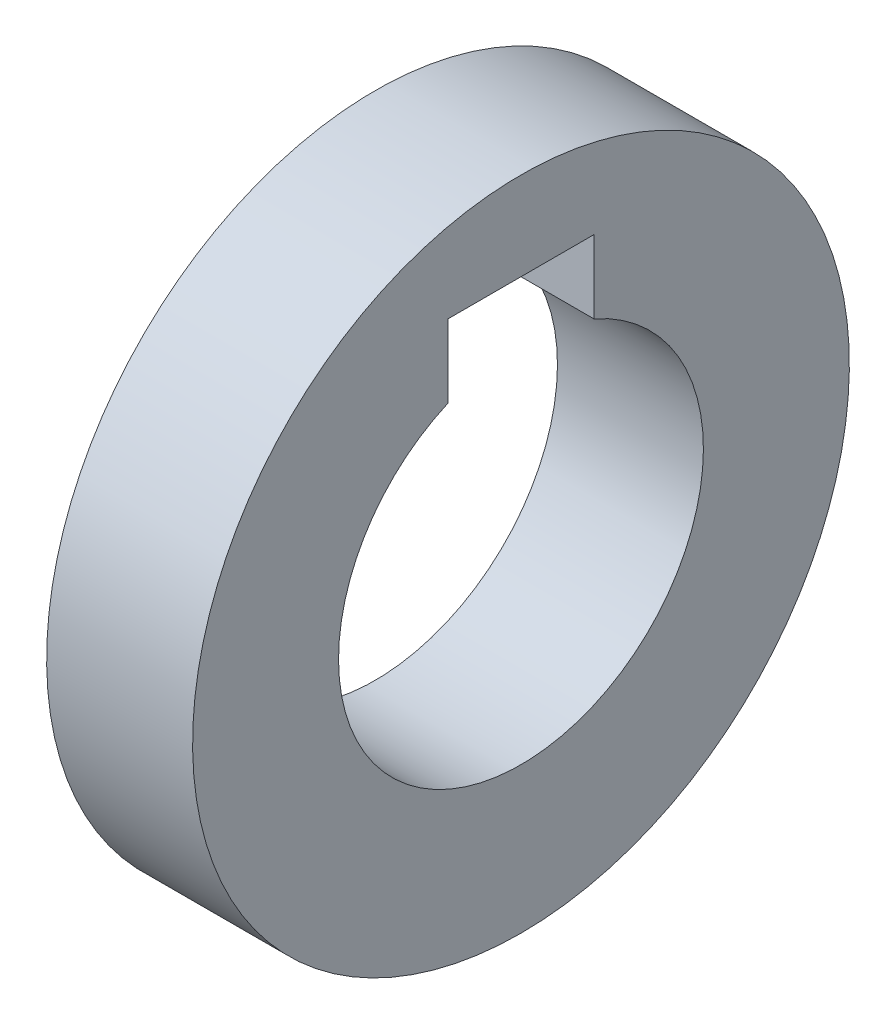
ISO-10303-21;
HEADER;
FILE_DESCRIPTION(('STEP AP214'),'2;1');
FILE_NAME('part.step','',(''),(''),'','','');
FILE_SCHEMA(('AUTOMOTIVE_DESIGN { 1 0 10303 214 1 1 1 1 }'));
ENDSEC;
DATA;
#1=APPLICATION_CONTEXT('core data for automotive mechanical design processes');
#2=APPLICATION_PROTOCOL_DEFINITION('international standard','automotive_design',2000,#1);
#3=PRODUCT_CONTEXT('',#1,'mechanical');
#4=PRODUCT('Part','Part','',(#3));
#5=PRODUCT_RELATED_PRODUCT_CATEGORY('part','',(#4));
#6=PRODUCT_DEFINITION_FORMATION('','',#4);
#7=PRODUCT_DEFINITION_CONTEXT('part definition',#1,'design');
#8=PRODUCT_DEFINITION('design','',#6,#7);
#9=PRODUCT_DEFINITION_SHAPE('','',#8);
#10=(LENGTH_UNIT() NAMED_UNIT(*) SI_UNIT(.MILLI.,.METRE.));
#11=(NAMED_UNIT(*) PLANE_ANGLE_UNIT() SI_UNIT($,.RADIAN.));
#12=(NAMED_UNIT(*) SI_UNIT($,.STERADIAN.) SOLID_ANGLE_UNIT());
#13=UNCERTAINTY_MEASURE_WITH_UNIT(LENGTH_MEASURE(1.E-05),#10,'distance_accuracy_value','');
#14=(GEOMETRIC_REPRESENTATION_CONTEXT(3) GLOBAL_UNCERTAINTY_ASSIGNED_CONTEXT((#13)) GLOBAL_UNIT_ASSIGNED_CONTEXT((#10,
#11,#12)) REPRESENTATION_CONTEXT('',''));
#15=CARTESIAN_POINT('',(0.,0.,0.));
#16=DIRECTION('',(0.,0.,1.));
#17=DIRECTION('',(1.,0.,0.));
#18=AXIS2_PLACEMENT_3D('',#15,#16,#17);
#19=CARTESIAN_POINT('',(-1.,2.5,0.));
#20=DIRECTION('',(1.,0.,0.));
#21=DIRECTION('',(0.,1.,0.));
#22=AXIS2_PLACEMENT_3D('',#19,#20,#21);
#23=PLANE('',#22);
#24=DIRECTION('',(0.,0.,1.));
#25=VECTOR('',#24,1.);
#26=CARTESIAN_POINT('',(-1.,3.29128784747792,1.));
#27=LINE('',#26,#25);
#28=CARTESIAN_POINT('',(-1.,3.29128784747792,-1.));
#29=VERTEX_POINT('',#28);
#30=CARTESIAN_POINT('',(-1.,3.29128784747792,1.));
#31=VERTEX_POINT('',#30);
#32=EDGE_CURVE('E86',#29,#31,#27,.T.);
#33=ORIENTED_EDGE('',*,*,#32,.T.);
#34=DIRECTION('',(0.,-1.,0.));
#35=VECTOR('',#34,1.);
#36=CARTESIAN_POINT('',(-1.,2.29128784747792,1.));
#37=LINE('',#36,#35);
#38=CARTESIAN_POINT('',(-1.,2.29128784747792,1.));
#39=VERTEX_POINT('',#38);
#40=EDGE_CURVE('E89',#31,#39,#37,.T.);
#41=ORIENTED_EDGE('',*,*,#40,.T.);
#42=CARTESIAN_POINT('',(-1.,0.,0.));
#43=DIRECTION('',(-1.,0.,0.));
#44=DIRECTION('',(0.,-1.,0.));
#45=AXIS2_PLACEMENT_3D('',#42,#43,#44);
#46=CIRCLE('',#45,2.5);
#47=CARTESIAN_POINT('',(-1.,2.29128784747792,-1.));
#48=VERTEX_POINT('',#47);
#49=EDGE_CURVE('E94',#48,#39,#46,.T.);
#50=ORIENTED_EDGE('',*,*,#49,.F.);
#51=DIRECTION('',(0.,1.,0.));
#52=VECTOR('',#51,1.);
#53=CARTESIAN_POINT('',(-1.,3.29128784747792,-1.));
#54=LINE('',#53,#52);
#55=EDGE_CURVE('E47',#48,#29,#54,.T.);
#56=ORIENTED_EDGE('',*,*,#55,.T.);
#57=EDGE_LOOP('',(#33,#41,#50,#56));
#58=FACE_BOUND('',#57,.T.);
#59=CARTESIAN_POINT('',(-0.999999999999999,0.,0.));
#60=DIRECTION('',(-1.,0.,0.));
#61=DIRECTION('',(0.,-1.,0.));
#62=AXIS2_PLACEMENT_3D('',#59,#60,#61);
#63=CIRCLE('',#62,4.5);
#64=CARTESIAN_POINT('',(-0.999999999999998,-4.5,0.));
#65=VERTEX_POINT('',#64);
#66=EDGE_CURVE('E11',#65,#65,#63,.T.);
#67=ORIENTED_EDGE('',*,*,#66,.T.);
#68=EDGE_LOOP('',(#67));
#69=FACE_BOUND('',#68,.T.);
#70=ADVANCED_FACE('F33',(#58,#69),#23,.F.);
#71=CARTESIAN_POINT('',(-1.,0.,0.));
#72=DIRECTION('',(-1.,0.,0.));
#73=DIRECTION('',(0.,-1.,0.));
#74=AXIS2_PLACEMENT_3D('',#71,#72,#73);
#75=CYLINDRICAL_SURFACE('',#74,4.5);
#76=ORIENTED_EDGE('',*,*,#66,.F.);
#77=EDGE_LOOP('',(#76));
#78=FACE_BOUND('',#77,.T.);
#79=CARTESIAN_POINT('',(1.,0.,0.));
#80=DIRECTION('',(-1.,0.,0.));
#81=DIRECTION('',(0.,-1.,0.));
#82=AXIS2_PLACEMENT_3D('',#79,#80,#81);
#83=CIRCLE('',#82,4.5);
#84=CARTESIAN_POINT('',(1.,-4.5,0.));
#85=VERTEX_POINT('',#84);
#86=EDGE_CURVE('E40',#85,#85,#83,.T.);
#87=ORIENTED_EDGE('',*,*,#86,.T.);
#88=EDGE_LOOP('',(#87));
#89=FACE_BOUND('',#88,.T.);
#90=ADVANCED_FACE('F111',(#78,#89),#75,.T.);
#91=CARTESIAN_POINT('',(1.,4.5,0.));
#92=DIRECTION('',(-1.,0.,0.));
#93=DIRECTION('',(0.,-1.,0.));
#94=AXIS2_PLACEMENT_3D('',#91,#92,#93);
#95=PLANE('',#94);
#96=ORIENTED_EDGE('',*,*,#86,.F.);
#97=EDGE_LOOP('',(#96));
#98=FACE_BOUND('',#97,.T.);
#99=CARTESIAN_POINT('',(1.,0.,0.));
#100=DIRECTION('',(-1.,0.,0.));
#101=DIRECTION('',(0.,-1.,0.));
#102=AXIS2_PLACEMENT_3D('',#99,#100,#101);
#103=CIRCLE('',#102,2.5);
#104=CARTESIAN_POINT('',(1.,2.29128784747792,-1.));
#105=VERTEX_POINT('',#104);
#106=CARTESIAN_POINT('',(1.,2.29128784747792,1.));
#107=VERTEX_POINT('',#106);
#108=EDGE_CURVE('E106',#105,#107,#103,.T.);
#109=ORIENTED_EDGE('',*,*,#108,.T.);
#110=DIRECTION('',(0.,-1.,0.));
#111=VECTOR('',#110,1.);
#112=CARTESIAN_POINT('',(1.,2.29128784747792,1.));
#113=LINE('',#112,#111);
#114=CARTESIAN_POINT('',(1.,3.29128784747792,1.));
#115=VERTEX_POINT('',#114);
#116=EDGE_CURVE('E72',#115,#107,#113,.T.);
#117=ORIENTED_EDGE('',*,*,#116,.F.);
#118=DIRECTION('',(0.,0.,1.));
#119=VECTOR('',#118,1.);
#120=CARTESIAN_POINT('',(1.,3.29128784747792,1.));
#121=LINE('',#120,#119);
#122=CARTESIAN_POINT('',(1.,3.29128784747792,-1.));
#123=VERTEX_POINT('',#122);
#124=EDGE_CURVE('E96',#123,#115,#121,.T.);
#125=ORIENTED_EDGE('',*,*,#124,.F.);
#126=DIRECTION('',(0.,1.,0.));
#127=VECTOR('',#126,1.);
#128=CARTESIAN_POINT('',(1.,3.29128784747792,-1.));
#129=LINE('',#128,#127);
#130=EDGE_CURVE('E78',#105,#123,#129,.T.);
#131=ORIENTED_EDGE('',*,*,#130,.F.);
#132=EDGE_LOOP('',(#109,#117,#125,#131));
#133=FACE_BOUND('',#132,.T.);
#134=ADVANCED_FACE('F113',(#98,#133),#95,.F.);
#135=CARTESIAN_POINT('',(-1.,0.,0.));
#136=DIRECTION('',(-1.,0.,0.));
#137=DIRECTION('',(0.,-1.,0.));
#138=AXIS2_PLACEMENT_3D('',#135,#136,#137);
#139=CYLINDRICAL_SURFACE('',#138,2.5);
#140=ORIENTED_EDGE('',*,*,#49,.T.);
#141=DIRECTION('',(1.,0.,0.));
#142=VECTOR('',#141,1.);
#143=CARTESIAN_POINT('',(-1.,2.29128784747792,1.));
#144=LINE('',#143,#142);
#145=EDGE_CURVE('E56',#39,#107,#144,.T.);
#146=ORIENTED_EDGE('',*,*,#145,.T.);
#147=ORIENTED_EDGE('',*,*,#108,.F.);
#148=DIRECTION('',(1.,0.,0.));
#149=VECTOR('',#148,1.);
#150=CARTESIAN_POINT('',(-1.,2.29128784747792,-1.));
#151=LINE('',#150,#149);
#152=EDGE_CURVE('E83',#48,#105,#151,.T.);
#153=ORIENTED_EDGE('',*,*,#152,.F.);
#154=EDGE_LOOP('',(#140,#146,#147,#153));
#155=FACE_BOUND('',#154,.T.);
#156=ADVANCED_FACE('F116',(#155),#139,.F.);
#157=CARTESIAN_POINT('',(-1.,2.29128784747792,1.));
#158=DIRECTION('',(0.,0.,1.));
#159=DIRECTION('',(1.,0.,0.));
#160=AXIS2_PLACEMENT_3D('',#157,#158,#159);
#161=PLANE('',#160);
#162=ORIENTED_EDGE('',*,*,#116,.T.);
#163=ORIENTED_EDGE('',*,*,#145,.F.);
#164=ORIENTED_EDGE('',*,*,#40,.F.);
#165=DIRECTION('',(1.,0.,0.));
#166=VECTOR('',#165,1.);
#167=CARTESIAN_POINT('',(-1.,3.29128784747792,1.));
#168=LINE('',#167,#166);
#169=EDGE_CURVE('E82',#31,#115,#168,.T.);
#170=ORIENTED_EDGE('',*,*,#169,.T.);
#171=EDGE_LOOP('',(#162,#163,#164,#170));
#172=FACE_BOUND('',#171,.T.);
#173=ADVANCED_FACE('F121',(#172),#161,.F.);
#174=CARTESIAN_POINT('',(-1.,3.29128784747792,1.));
#175=DIRECTION('',(0.,1.,0.));
#176=DIRECTION('',(-1.,0.,0.));
#177=AXIS2_PLACEMENT_3D('',#174,#175,#176);
#178=PLANE('',#177);
#179=ORIENTED_EDGE('',*,*,#124,.T.);
#180=ORIENTED_EDGE('',*,*,#169,.F.);
#181=ORIENTED_EDGE('',*,*,#32,.F.);
#182=DIRECTION('',(1.,0.,0.));
#183=VECTOR('',#182,1.);
#184=CARTESIAN_POINT('',(-1.,3.29128784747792,-1.));
#185=LINE('',#184,#183);
#186=EDGE_CURVE('E74',#29,#123,#185,.T.);
#187=ORIENTED_EDGE('',*,*,#186,.T.);
#188=EDGE_LOOP('',(#179,#180,#181,#187));
#189=FACE_BOUND('',#188,.T.);
#190=ADVANCED_FACE('F87',(#189),#178,.F.);
#191=CARTESIAN_POINT('',(-1.,3.29128784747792,-1.));
#192=DIRECTION('',(0.,0.,-1.));
#193=DIRECTION('',(-1.,0.,0.));
#194=AXIS2_PLACEMENT_3D('',#191,#192,#193);
#195=PLANE('',#194);
#196=ORIENTED_EDGE('',*,*,#130,.T.);
#197=ORIENTED_EDGE('',*,*,#186,.F.);
#198=ORIENTED_EDGE('',*,*,#55,.F.);
#199=ORIENTED_EDGE('',*,*,#152,.T.);
#200=EDGE_LOOP('',(#196,#197,#198,#199));
#201=FACE_BOUND('',#200,.T.);
#202=ADVANCED_FACE('F76',(#201),#195,.F.);
#203=CLOSED_SHELL('',(#70,#90,#134,#156,#173,#190,#202));
#204=MANIFOLD_SOLID_BREP('B2',#203);
#205=ADVANCED_BREP_SHAPE_REPRESENTATION('',(#18,#204),#14);
#206=SHAPE_DEFINITION_REPRESENTATION(#9,#205);
ENDSEC;
END-ISO-10303-21;
